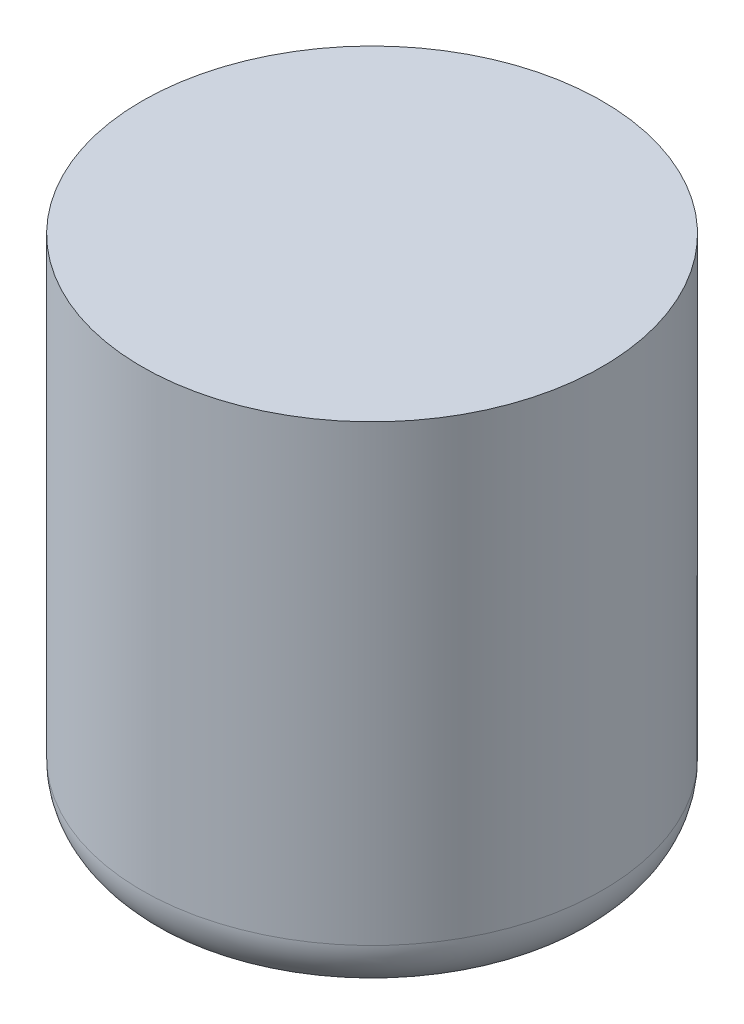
from build123d import *


with BuildPart() as part:
    # Esquisse1 → R_volution1 (revolve)
    with BuildSketch(Plane.XY):
        with BuildLine():
            Line((-120.008687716, 54.638906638), (-120.008687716, 151.378906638))
            Line((-120.008687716, 151.378906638), (-70.918687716, 151.378906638))
            Line((-70.918687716, 151.378906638), (-70.918687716, 46.148906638))
            Line((-70.918687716, 46.148906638), (-116.489247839, 46.148906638))
            ThreePointArc((-116.489247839, 46.148906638), (-119.093964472, 50.043622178), (-120.008687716, 54.638906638))
        make_face()
    revolve(axis=Axis((-70.918687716, 164.899410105, 0), (0, -1, 0)))


solid = part.part
